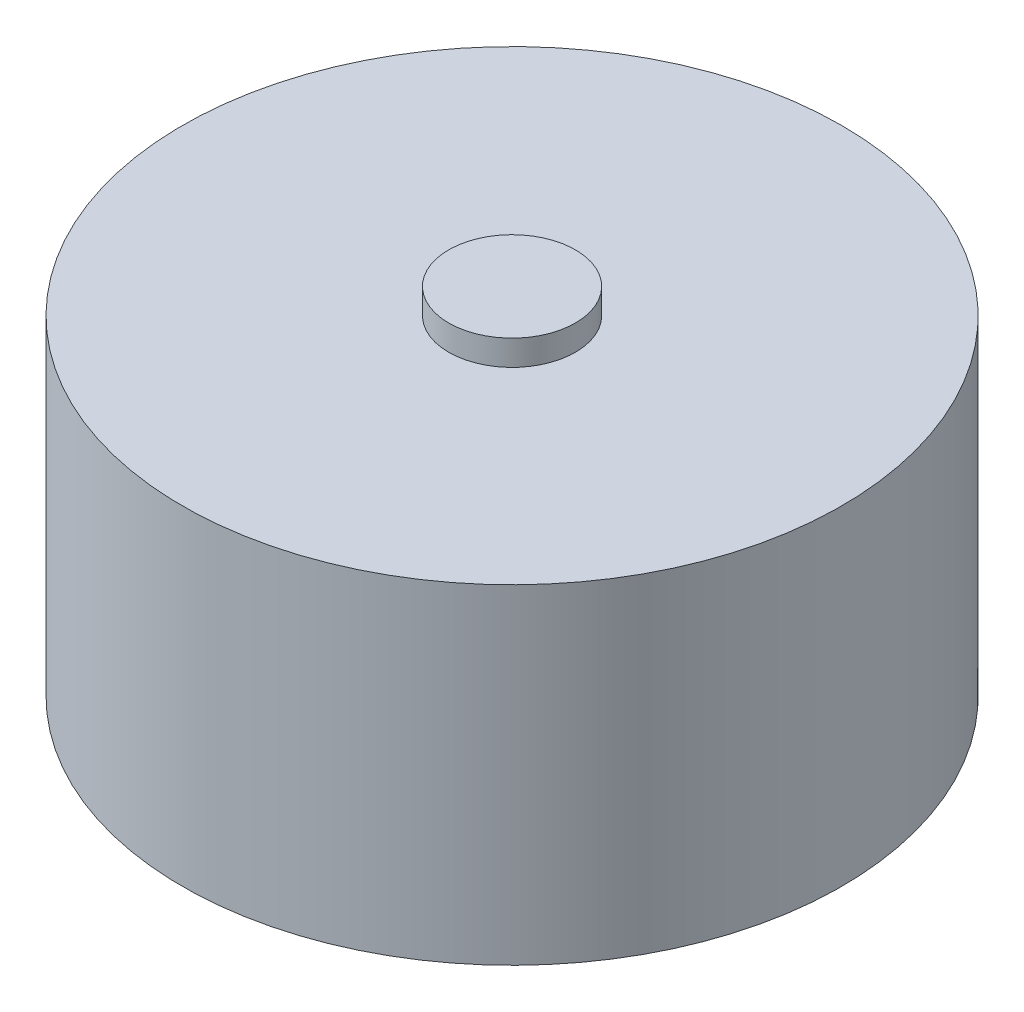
from build123d import *

# Parameters (mm, degrees)
SKETCH1_R           = 6.5
BOSS_EXTRUDE1_DEPTH = 6.5
SKETCH2_R           = 1.25
BOSS_EXTRUDE2_DEPTH = 0.5


with BuildPart() as part:
    # Sketch1 → Boss-Extrude1 (new body)
    with BuildSketch(Plane(origin=(0, 0, 0), x_dir=(1, 0, 0), z_dir=(0, 1, 0))):
        with Locations(Location((0, 0, 0), (0, 0, 90))):
            Circle(SKETCH1_R)
    extrude(amount=BOSS_EXTRUDE1_DEPTH)

    # Sketch2 → Boss-Extrude2 (add)
    with BuildSketch(Plane(origin=(0, 6.5, 0), x_dir=(1, 0, 0), z_dir=(0, 1, 0))):
        with Locations(Location((0, 0, 0), (0, 0, 270))):
            Circle(SKETCH2_R)
    extrude(amount=BOSS_EXTRUDE2_DEPTH)


solid = part.part
